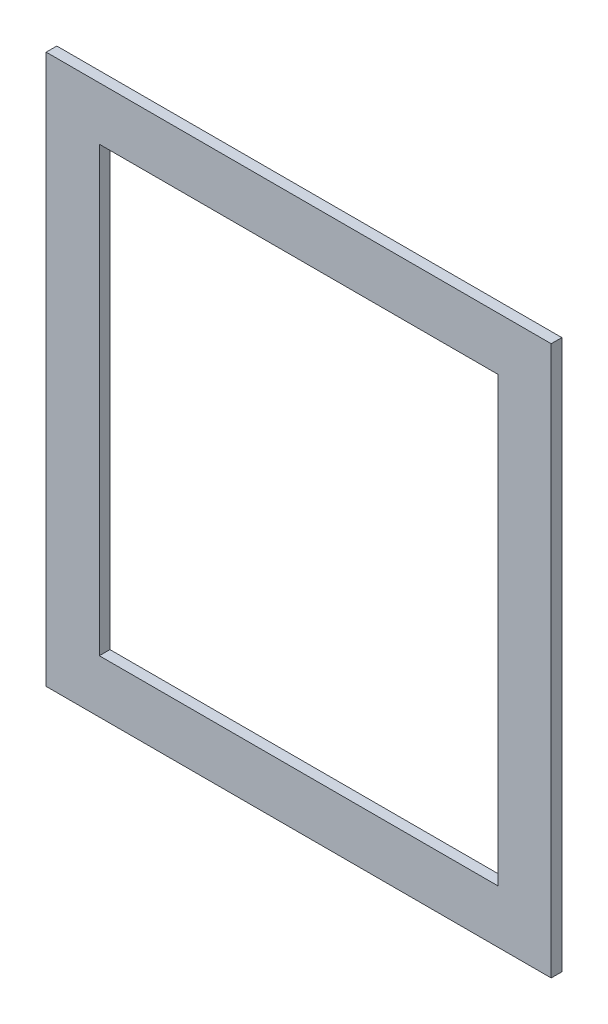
ISO-10303-21;
HEADER;
FILE_DESCRIPTION(('STEP AP214'),'2;1');
FILE_NAME('part.step','',(''),(''),'','','');
FILE_SCHEMA(('AUTOMOTIVE_DESIGN { 1 0 10303 214 1 1 1 1 }'));
ENDSEC;
DATA;
#1=APPLICATION_CONTEXT('core data for automotive mechanical design processes');
#2=APPLICATION_PROTOCOL_DEFINITION('international standard','automotive_design',2000,#1);
#3=PRODUCT_CONTEXT('',#1,'mechanical');
#4=PRODUCT('Part','Part','',(#3));
#5=PRODUCT_RELATED_PRODUCT_CATEGORY('part','',(#4));
#6=PRODUCT_DEFINITION_FORMATION('','',#4);
#7=PRODUCT_DEFINITION_CONTEXT('part definition',#1,'design');
#8=PRODUCT_DEFINITION('design','',#6,#7);
#9=PRODUCT_DEFINITION_SHAPE('','',#8);
#10=(LENGTH_UNIT() NAMED_UNIT(*) SI_UNIT(.MILLI.,.METRE.));
#11=(NAMED_UNIT(*) PLANE_ANGLE_UNIT() SI_UNIT($,.RADIAN.));
#12=(NAMED_UNIT(*) SI_UNIT($,.STERADIAN.) SOLID_ANGLE_UNIT());
#13=UNCERTAINTY_MEASURE_WITH_UNIT(LENGTH_MEASURE(1.E-05),#10,'distance_accuracy_value','');
#14=(GEOMETRIC_REPRESENTATION_CONTEXT(3) GLOBAL_UNCERTAINTY_ASSIGNED_CONTEXT((#13)) GLOBAL_UNIT_ASSIGNED_CONTEXT((#10,
#11,#12)) REPRESENTATION_CONTEXT('',''));
#15=CARTESIAN_POINT('',(0.,0.,0.));
#16=DIRECTION('',(0.,0.,1.));
#17=DIRECTION('',(1.,0.,0.));
#18=AXIS2_PLACEMENT_3D('',#15,#16,#17);
#19=CARTESIAN_POINT('',(0.,0.,12.));
#20=DIRECTION('',(0.,0.,1.));
#21=DIRECTION('',(1.,0.,0.));
#22=AXIS2_PLACEMENT_3D('',#19,#20,#21);
#23=PLANE('',#22);
#24=DIRECTION('',(0.,-1.,0.));
#25=VECTOR('',#24,1.);
#26=CARTESIAN_POINT('',(-225.,250.,12.));
#27=LINE('',#26,#25);
#28=CARTESIAN_POINT('',(-225.,250.,12.));
#29=VERTEX_POINT('',#28);
#30=CARTESIAN_POINT('',(-225.,-250.,12.));
#31=VERTEX_POINT('',#30);
#32=EDGE_CURVE('E24',#29,#31,#27,.T.);
#33=ORIENTED_EDGE('',*,*,#32,.F.);
#34=DIRECTION('',(-1.,0.,0.));
#35=VECTOR('',#34,1.);
#36=CARTESIAN_POINT('',(225.,250.,12.));
#37=LINE('',#36,#35);
#38=CARTESIAN_POINT('',(225.,250.,12.));
#39=VERTEX_POINT('',#38);
#40=EDGE_CURVE('E66',#39,#29,#37,.T.);
#41=ORIENTED_EDGE('',*,*,#40,.F.);
#42=DIRECTION('',(0.,1.,0.));
#43=VECTOR('',#42,1.);
#44=CARTESIAN_POINT('',(225.,-250.,12.));
#45=LINE('',#44,#43);
#46=CARTESIAN_POINT('',(225.,-250.,12.));
#47=VERTEX_POINT('',#46);
#48=EDGE_CURVE('E155',#47,#39,#45,.T.);
#49=ORIENTED_EDGE('',*,*,#48,.F.);
#50=DIRECTION('',(1.,0.,0.));
#51=VECTOR('',#50,1.);
#52=CARTESIAN_POINT('',(-225.,-250.,12.));
#53=LINE('',#52,#51);
#54=EDGE_CURVE('E148',#31,#47,#53,.T.);
#55=ORIENTED_EDGE('',*,*,#54,.F.);
#56=EDGE_LOOP('',(#33,#41,#49,#55));
#57=FACE_BOUND('',#56,.T.);
#58=DIRECTION('',(1.,0.,0.));
#59=VECTOR('',#58,1.);
#60=CARTESIAN_POINT('',(-285.,-310.,12.));
#61=LINE('',#60,#59);
#62=CARTESIAN_POINT('',(-285.,-310.,12.));
#63=VERTEX_POINT('',#62);
#64=CARTESIAN_POINT('',(285.,-310.,12.));
#65=VERTEX_POINT('',#64);
#66=EDGE_CURVE('E187',#63,#65,#61,.T.);
#67=ORIENTED_EDGE('',*,*,#66,.T.);
#68=DIRECTION('',(0.,1.,0.));
#69=VECTOR('',#68,1.);
#70=CARTESIAN_POINT('',(285.,-310.,12.));
#71=LINE('',#70,#69);
#72=CARTESIAN_POINT('',(285.,310.,12.));
#73=VERTEX_POINT('',#72);
#74=EDGE_CURVE('E131',#65,#73,#71,.T.);
#75=ORIENTED_EDGE('',*,*,#74,.T.);
#76=DIRECTION('',(-1.,0.,0.));
#77=VECTOR('',#76,1.);
#78=CARTESIAN_POINT('',(285.,310.,12.));
#79=LINE('',#78,#77);
#80=CARTESIAN_POINT('',(-285.,310.,12.));
#81=VERTEX_POINT('',#80);
#82=EDGE_CURVE('E130',#73,#81,#79,.T.);
#83=ORIENTED_EDGE('',*,*,#82,.T.);
#84=DIRECTION('',(0.,-1.,0.));
#85=VECTOR('',#84,1.);
#86=CARTESIAN_POINT('',(-285.,310.,12.));
#87=LINE('',#86,#85);
#88=EDGE_CURVE('E115',#81,#63,#87,.T.);
#89=ORIENTED_EDGE('',*,*,#88,.T.);
#90=EDGE_LOOP('',(#67,#75,#83,#89));
#91=FACE_BOUND('',#90,.T.);
#92=ADVANCED_FACE('F16',(#57,#91),#23,.T.);
#93=CARTESIAN_POINT('',(0.,0.,0.));
#94=DIRECTION('',(0.,0.,1.));
#95=DIRECTION('',(1.,0.,0.));
#96=AXIS2_PLACEMENT_3D('',#93,#94,#95);
#97=PLANE('',#96);
#98=DIRECTION('',(1.,0.,0.));
#99=VECTOR('',#98,1.);
#100=CARTESIAN_POINT('',(-225.,-250.,0.));
#101=LINE('',#100,#99);
#102=CARTESIAN_POINT('',(-225.,-250.,0.));
#103=VERTEX_POINT('',#102);
#104=CARTESIAN_POINT('',(225.,-250.,0.));
#105=VERTEX_POINT('',#104);
#106=EDGE_CURVE('E160',#103,#105,#101,.T.);
#107=ORIENTED_EDGE('',*,*,#106,.T.);
#108=DIRECTION('',(0.,1.,0.));
#109=VECTOR('',#108,1.);
#110=CARTESIAN_POINT('',(225.,-250.,0.));
#111=LINE('',#110,#109);
#112=CARTESIAN_POINT('',(225.,250.,0.));
#113=VERTEX_POINT('',#112);
#114=EDGE_CURVE('E78',#105,#113,#111,.T.);
#115=ORIENTED_EDGE('',*,*,#114,.T.);
#116=DIRECTION('',(-1.,0.,0.));
#117=VECTOR('',#116,1.);
#118=CARTESIAN_POINT('',(225.,250.,0.));
#119=LINE('',#118,#117);
#120=CARTESIAN_POINT('',(-225.,250.,0.));
#121=VERTEX_POINT('',#120);
#122=EDGE_CURVE('E167',#113,#121,#119,.T.);
#123=ORIENTED_EDGE('',*,*,#122,.T.);
#124=DIRECTION('',(0.,-1.,0.));
#125=VECTOR('',#124,1.);
#126=CARTESIAN_POINT('',(-225.,250.,0.));
#127=LINE('',#126,#125);
#128=EDGE_CURVE('E10',#121,#103,#127,.T.);
#129=ORIENTED_EDGE('',*,*,#128,.T.);
#130=EDGE_LOOP('',(#107,#115,#123,#129));
#131=FACE_BOUND('',#130,.T.);
#132=DIRECTION('',(0.,-1.,0.));
#133=VECTOR('',#132,1.);
#134=CARTESIAN_POINT('',(-285.,310.,0.));
#135=LINE('',#134,#133);
#136=CARTESIAN_POINT('',(-285.,310.,0.));
#137=VERTEX_POINT('',#136);
#138=CARTESIAN_POINT('',(-285.,-310.,0.));
#139=VERTEX_POINT('',#138);
#140=EDGE_CURVE('E109',#137,#139,#135,.T.);
#141=ORIENTED_EDGE('',*,*,#140,.F.);
#142=DIRECTION('',(-1.,0.,0.));
#143=VECTOR('',#142,1.);
#144=CARTESIAN_POINT('',(285.,310.,0.));
#145=LINE('',#144,#143);
#146=CARTESIAN_POINT('',(285.,310.,0.));
#147=VERTEX_POINT('',#146);
#148=EDGE_CURVE('E138',#147,#137,#145,.T.);
#149=ORIENTED_EDGE('',*,*,#148,.F.);
#150=DIRECTION('',(0.,1.,0.));
#151=VECTOR('',#150,1.);
#152=CARTESIAN_POINT('',(285.,-310.,0.));
#153=LINE('',#152,#151);
#154=CARTESIAN_POINT('',(285.,-310.,0.));
#155=VERTEX_POINT('',#154);
#156=EDGE_CURVE('E191',#155,#147,#153,.T.);
#157=ORIENTED_EDGE('',*,*,#156,.F.);
#158=DIRECTION('',(1.,0.,0.));
#159=VECTOR('',#158,1.);
#160=CARTESIAN_POINT('',(-285.,-310.,0.));
#161=LINE('',#160,#159);
#162=EDGE_CURVE('E215',#139,#155,#161,.T.);
#163=ORIENTED_EDGE('',*,*,#162,.F.);
#164=EDGE_LOOP('',(#141,#149,#157,#163));
#165=FACE_BOUND('',#164,.T.);
#166=ADVANCED_FACE('F214',(#131,#165),#97,.F.);
#167=CARTESIAN_POINT('',(-225.,250.,0.));
#168=DIRECTION('',(1.,0.,0.));
#169=DIRECTION('',(0.,1.,0.));
#170=AXIS2_PLACEMENT_3D('',#167,#168,#169);
#171=PLANE('',#170);
#172=DIRECTION('',(0.,0.,1.));
#173=VECTOR('',#172,1.);
#174=CARTESIAN_POINT('',(-225.,250.,0.));
#175=LINE('',#174,#173);
#176=EDGE_CURVE('E146',#121,#29,#175,.T.);
#177=ORIENTED_EDGE('',*,*,#176,.T.);
#178=ORIENTED_EDGE('',*,*,#32,.T.);
#179=DIRECTION('',(0.,0.,1.));
#180=VECTOR('',#179,1.);
#181=CARTESIAN_POINT('',(-225.,-250.,0.));
#182=LINE('',#181,#180);
#183=EDGE_CURVE('E127',#103,#31,#182,.T.);
#184=ORIENTED_EDGE('',*,*,#183,.F.);
#185=ORIENTED_EDGE('',*,*,#128,.F.);
#186=EDGE_LOOP('',(#177,#178,#184,#185));
#187=FACE_BOUND('',#186,.T.);
#188=ADVANCED_FACE('F171',(#187),#171,.T.);
#189=CARTESIAN_POINT('',(225.,250.,0.));
#190=DIRECTION('',(0.,-1.,0.));
#191=DIRECTION('',(0.,0.,-1.));
#192=AXIS2_PLACEMENT_3D('',#189,#190,#191);
#193=PLANE('',#192);
#194=DIRECTION('',(0.,0.,1.));
#195=VECTOR('',#194,1.);
#196=CARTESIAN_POINT('',(225.,250.,0.));
#197=LINE('',#196,#195);
#198=EDGE_CURVE('E159',#113,#39,#197,.T.);
#199=ORIENTED_EDGE('',*,*,#198,.T.);
#200=ORIENTED_EDGE('',*,*,#40,.T.);
#201=ORIENTED_EDGE('',*,*,#176,.F.);
#202=ORIENTED_EDGE('',*,*,#122,.F.);
#203=EDGE_LOOP('',(#199,#200,#201,#202));
#204=FACE_BOUND('',#203,.T.);
#205=ADVANCED_FACE('F226',(#204),#193,.T.);
#206=CARTESIAN_POINT('',(225.,-250.,0.));
#207=DIRECTION('',(-1.,0.,0.));
#208=DIRECTION('',(0.,0.,1.));
#209=AXIS2_PLACEMENT_3D('',#206,#207,#208);
#210=PLANE('',#209);
#211=DIRECTION('',(0.,0.,1.));
#212=VECTOR('',#211,1.);
#213=CARTESIAN_POINT('',(225.,-250.,0.));
#214=LINE('',#213,#212);
#215=EDGE_CURVE('E152',#105,#47,#214,.T.);
#216=ORIENTED_EDGE('',*,*,#215,.T.);
#217=ORIENTED_EDGE('',*,*,#48,.T.);
#218=ORIENTED_EDGE('',*,*,#198,.F.);
#219=ORIENTED_EDGE('',*,*,#114,.F.);
#220=EDGE_LOOP('',(#216,#217,#218,#219));
#221=FACE_BOUND('',#220,.T.);
#222=ADVANCED_FACE('F224',(#221),#210,.T.);
#223=CARTESIAN_POINT('',(-225.,-250.,0.));
#224=DIRECTION('',(0.,1.,0.));
#225=DIRECTION('',(1.,0.,0.));
#226=AXIS2_PLACEMENT_3D('',#223,#224,#225);
#227=PLANE('',#226);
#228=ORIENTED_EDGE('',*,*,#183,.T.);
#229=ORIENTED_EDGE('',*,*,#54,.T.);
#230=ORIENTED_EDGE('',*,*,#215,.F.);
#231=ORIENTED_EDGE('',*,*,#106,.F.);
#232=EDGE_LOOP('',(#228,#229,#230,#231));
#233=FACE_BOUND('',#232,.T.);
#234=ADVANCED_FACE('F177',(#233),#227,.T.);
#235=CARTESIAN_POINT('',(-285.,310.,0.));
#236=DIRECTION('',(1.,0.,0.));
#237=DIRECTION('',(0.,1.,0.));
#238=AXIS2_PLACEMENT_3D('',#235,#236,#237);
#239=PLANE('',#238);
#240=ORIENTED_EDGE('',*,*,#140,.T.);
#241=DIRECTION('',(0.,0.,1.));
#242=VECTOR('',#241,1.);
#243=CARTESIAN_POINT('',(-285.,-310.,0.));
#244=LINE('',#243,#242);
#245=EDGE_CURVE('E122',#139,#63,#244,.T.);
#246=ORIENTED_EDGE('',*,*,#245,.T.);
#247=ORIENTED_EDGE('',*,*,#88,.F.);
#248=DIRECTION('',(0.,0.,1.));
#249=VECTOR('',#248,1.);
#250=CARTESIAN_POINT('',(-285.,310.,0.));
#251=LINE('',#250,#249);
#252=EDGE_CURVE('E119',#137,#81,#251,.T.);
#253=ORIENTED_EDGE('',*,*,#252,.F.);
#254=EDGE_LOOP('',(#240,#246,#247,#253));
#255=FACE_BOUND('',#254,.T.);
#256=ADVANCED_FACE('F117',(#255),#239,.F.);
#257=CARTESIAN_POINT('',(285.,310.,0.));
#258=DIRECTION('',(0.,-1.,0.));
#259=DIRECTION('',(0.,0.,-1.));
#260=AXIS2_PLACEMENT_3D('',#257,#258,#259);
#261=PLANE('',#260);
#262=ORIENTED_EDGE('',*,*,#148,.T.);
#263=ORIENTED_EDGE('',*,*,#252,.T.);
#264=ORIENTED_EDGE('',*,*,#82,.F.);
#265=DIRECTION('',(0.,0.,1.));
#266=VECTOR('',#265,1.);
#267=CARTESIAN_POINT('',(285.,310.,0.));
#268=LINE('',#267,#266);
#269=EDGE_CURVE('E194',#147,#73,#268,.T.);
#270=ORIENTED_EDGE('',*,*,#269,.F.);
#271=EDGE_LOOP('',(#262,#263,#264,#270));
#272=FACE_BOUND('',#271,.T.);
#273=ADVANCED_FACE('F137',(#272),#261,.F.);
#274=CARTESIAN_POINT('',(285.,-310.,0.));
#275=DIRECTION('',(-1.,0.,0.));
#276=DIRECTION('',(0.,0.,1.));
#277=AXIS2_PLACEMENT_3D('',#274,#275,#276);
#278=PLANE('',#277);
#279=ORIENTED_EDGE('',*,*,#156,.T.);
#280=ORIENTED_EDGE('',*,*,#269,.T.);
#281=ORIENTED_EDGE('',*,*,#74,.F.);
#282=DIRECTION('',(0.,0.,1.));
#283=VECTOR('',#282,1.);
#284=CARTESIAN_POINT('',(285.,-310.,0.));
#285=LINE('',#284,#283);
#286=EDGE_CURVE('E185',#155,#65,#285,.T.);
#287=ORIENTED_EDGE('',*,*,#286,.F.);
#288=EDGE_LOOP('',(#279,#280,#281,#287));
#289=FACE_BOUND('',#288,.T.);
#290=ADVANCED_FACE('F210',(#289),#278,.F.);
#291=CARTESIAN_POINT('',(-285.,-310.,0.));
#292=DIRECTION('',(0.,1.,0.));
#293=DIRECTION('',(1.,0.,0.));
#294=AXIS2_PLACEMENT_3D('',#291,#292,#293);
#295=PLANE('',#294);
#296=ORIENTED_EDGE('',*,*,#162,.T.);
#297=ORIENTED_EDGE('',*,*,#286,.T.);
#298=ORIENTED_EDGE('',*,*,#66,.F.);
#299=ORIENTED_EDGE('',*,*,#245,.F.);
#300=EDGE_LOOP('',(#296,#297,#298,#299));
#301=FACE_BOUND('',#300,.T.);
#302=ADVANCED_FACE('F248',(#301),#295,.F.);
#303=CLOSED_SHELL('',(#92,#166,#188,#205,#222,#234,#256,#273,#290,#302));
#304=MANIFOLD_SOLID_BREP('B1',#303);
#305=ADVANCED_BREP_SHAPE_REPRESENTATION('',(#18,#304),#14);
#306=SHAPE_DEFINITION_REPRESENTATION(#9,#305);
ENDSEC;
END-ISO-10303-21;
